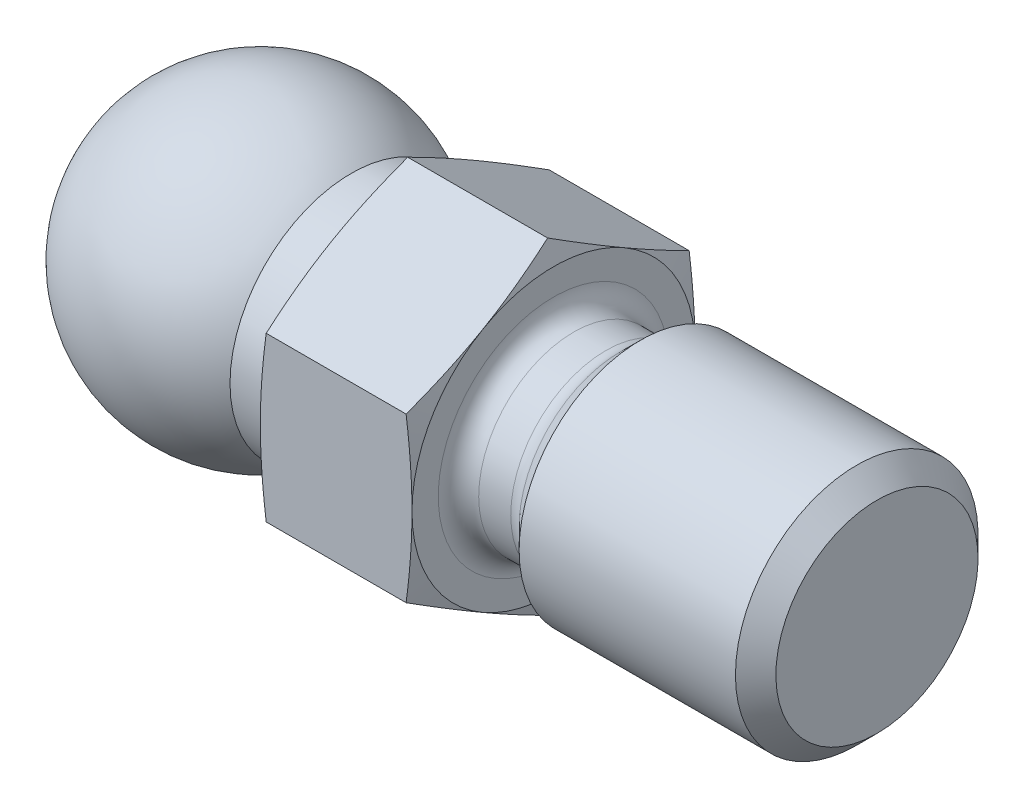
ISO-10303-21;
HEADER;
FILE_DESCRIPTION(('STEP AP214'),'2;1');
FILE_NAME('part.step','',(''),(''),'','','');
FILE_SCHEMA(('AUTOMOTIVE_DESIGN { 1 0 10303 214 1 1 1 1 }'));
ENDSEC;
DATA;
#1=APPLICATION_CONTEXT('core data for automotive mechanical design processes');
#2=APPLICATION_PROTOCOL_DEFINITION('international standard','automotive_design',2000,#1);
#3=PRODUCT_CONTEXT('',#1,'mechanical');
#4=PRODUCT('Part','Part','',(#3));
#5=PRODUCT_RELATED_PRODUCT_CATEGORY('part','',(#4));
#6=PRODUCT_DEFINITION_FORMATION('','',#4);
#7=PRODUCT_DEFINITION_CONTEXT('part definition',#1,'design');
#8=PRODUCT_DEFINITION('design','',#6,#7);
#9=PRODUCT_DEFINITION_SHAPE('','',#8);
#10=(LENGTH_UNIT() NAMED_UNIT(*) SI_UNIT(.MILLI.,.METRE.));
#11=(NAMED_UNIT(*) PLANE_ANGLE_UNIT() SI_UNIT($,.RADIAN.));
#12=(NAMED_UNIT(*) SI_UNIT($,.STERADIAN.) SOLID_ANGLE_UNIT());
#13=UNCERTAINTY_MEASURE_WITH_UNIT(LENGTH_MEASURE(1.E-05),#10,'distance_accuracy_value','');
#14=(GEOMETRIC_REPRESENTATION_CONTEXT(3) GLOBAL_UNCERTAINTY_ASSIGNED_CONTEXT((#13)) GLOBAL_UNIT_ASSIGNED_CONTEXT((#10,
#11,#12)) REPRESENTATION_CONTEXT('',''));
#15=CARTESIAN_POINT('',(0.,0.,0.));
#16=DIRECTION('',(0.,0.,1.));
#17=DIRECTION('',(1.,0.,0.));
#18=AXIS2_PLACEMENT_3D('',#15,#16,#17);
#19=CARTESIAN_POINT('',(16.,16.7012618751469,-25.));
#20=DIRECTION('',(-1.,0.,0.));
#21=DIRECTION('',(0.,-1.,0.));
#22=AXIS2_PLACEMENT_3D('',#19,#20,#21);
#23=PLANE('',#22);
#24=CARTESIAN_POINT('',(16.0000000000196,0.,0.));
#25=DIRECTION('',(-1.,0.,0.));
#26=DIRECTION('',(0.,-1.,0.));
#27=AXIS2_PLACEMENT_3D('',#24,#25,#26);
#28=CIRCLE('',#27,5.0000000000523);
#29=CARTESIAN_POINT('',(16.0000000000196,-5.0000000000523,0.));
#30=VERTEX_POINT('',#29);
#31=EDGE_CURVE('E20',#30,#30,#28,.T.);
#32=ORIENTED_EDGE('',*,*,#31,.F.);
#33=EDGE_LOOP('',(#32));
#34=FACE_BOUND('',#33,.T.);
#35=ADVANCED_FACE('F16',(#34),#23,.F.);
#36=CARTESIAN_POINT('',(15.0000000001,0.,0.));
#37=DIRECTION('',(-1.,0.,0.));
#38=DIRECTION('',(0.,-1.,0.));
#39=AXIS2_PLACEMENT_3D('',#36,#37,#38);
#40=CONICAL_SURFACE('',#39,5.99999999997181,0.785398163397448);
#41=ORIENTED_EDGE('',*,*,#31,.T.);
#42=EDGE_LOOP('',(#41));
#43=FACE_BOUND('',#42,.T.);
#44=CARTESIAN_POINT('',(15.,0.,0.));
#45=DIRECTION('',(-1.,0.,0.));
#46=DIRECTION('',(0.,0.,1.));
#47=AXIS2_PLACEMENT_3D('',#44,#45,#46);
#48=CIRCLE('',#47,6.);
#49=CARTESIAN_POINT('',(15.,0.,6.));
#50=VERTEX_POINT('',#49);
#51=EDGE_CURVE('E427',#50,#50,#48,.T.);
#52=ORIENTED_EDGE('',*,*,#51,.F.);
#53=EDGE_LOOP('',(#52));
#54=FACE_BOUND('',#53,.T.);
#55=ADVANCED_FACE('F177',(#43,#54),#40,.T.);
#56=CARTESIAN_POINT('',(45.,0.,0.));
#57=DIRECTION('',(-1.,0.,0.));
#58=DIRECTION('',(0.,0.,1.));
#59=AXIS2_PLACEMENT_3D('',#56,#57,#58);
#60=CYLINDRICAL_SURFACE('',#59,6.);
#61=ORIENTED_EDGE('',*,*,#51,.T.);
#62=EDGE_LOOP('',(#61));
#63=FACE_BOUND('',#62,.T.);
#64=CARTESIAN_POINT('',(4.30000000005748,0.,0.));
#65=DIRECTION('',(1.,0.,0.));
#66=DIRECTION('',(0.,0.,-1.));
#67=AXIS2_PLACEMENT_3D('',#64,#65,#66);
#68=CIRCLE('',#67,6.00000000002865);
#69=CARTESIAN_POINT('',(4.30000000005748,0.,-6.00000000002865));
#70=VERTEX_POINT('',#69);
#71=EDGE_CURVE('E425',#70,#70,#68,.F.);
#72=ORIENTED_EDGE('',*,*,#71,.F.);
#73=EDGE_LOOP('',(#72));
#74=FACE_BOUND('',#73,.T.);
#75=ADVANCED_FACE('F173',(#63,#74),#60,.T.);
#76=CARTESIAN_POINT('',(4.30000000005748,0.,0.));
#77=DIRECTION('',(1.,0.,0.));
#78=DIRECTION('',(0.,0.,-1.));
#79=AXIS2_PLACEMENT_3D('',#76,#77,#78);
#80=CONICAL_SURFACE('',#79,6.00000000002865,0.785398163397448);
#81=CARTESIAN_POINT('',(3.29289321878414,0.,0.));
#82=DIRECTION('',(1.,0.,0.));
#83=DIRECTION('',(0.,0.,-1.));
#84=AXIS2_PLACEMENT_3D('',#81,#82,#83);
#85=CIRCLE('',#84,4.99289321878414);
#86=CARTESIAN_POINT('',(3.29289321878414,0.,-4.99289321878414));
#87=VERTEX_POINT('',#86);
#88=EDGE_CURVE('E422',#87,#87,#85,.T.);
#89=ORIENTED_EDGE('',*,*,#88,.T.);
#90=EDGE_LOOP('',(#89));
#91=FACE_BOUND('',#90,.T.);
#92=ORIENTED_EDGE('',*,*,#71,.T.);
#93=EDGE_LOOP('',(#92));
#94=FACE_BOUND('',#93,.T.);
#95=ADVANCED_FACE('F170',(#91,#94),#80,.T.);
#96=CARTESIAN_POINT('',(2.5857864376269,0.,0.));
#97=DIRECTION('',(1.,0.,0.));
#98=DIRECTION('',(0.,0.,-1.));
#99=AXIS2_PLACEMENT_3D('',#96,#97,#98);
#100=TOROIDAL_SURFACE('',#99,5.70000000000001,1.00000000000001);
#101=CARTESIAN_POINT('',(2.5857864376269,0.,0.));
#102=DIRECTION('',(-1.,0.,0.));
#103=DIRECTION('',(0.,0.,1.));
#104=AXIS2_PLACEMENT_3D('',#101,#102,#103);
#105=CIRCLE('',#104,4.7);
#106=CARTESIAN_POINT('',(2.5857864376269,0.,4.7));
#107=VERTEX_POINT('',#106);
#108=EDGE_CURVE('E419',#107,#107,#105,.T.);
#109=ORIENTED_EDGE('',*,*,#108,.F.);
#110=EDGE_LOOP('',(#109));
#111=FACE_BOUND('',#110,.T.);
#112=ORIENTED_EDGE('',*,*,#88,.F.);
#113=EDGE_LOOP('',(#112));
#114=FACE_BOUND('',#113,.T.);
#115=ADVANCED_FACE('F168',(#111,#114),#100,.F.);
#116=CARTESIAN_POINT('',(45.,0.,0.));
#117=DIRECTION('',(-1.,0.,0.));
#118=DIRECTION('',(0.,0.,1.));
#119=AXIS2_PLACEMENT_3D('',#116,#117,#118);
#120=CYLINDRICAL_SURFACE('',#119,4.7);
#121=ORIENTED_EDGE('',*,*,#108,.T.);
#122=EDGE_LOOP('',(#121));
#123=FACE_BOUND('',#122,.T.);
#124=CARTESIAN_POINT('',(1.,0.,0.));
#125=DIRECTION('',(1.,0.,0.));
#126=DIRECTION('',(0.,0.,-1.));
#127=AXIS2_PLACEMENT_3D('',#124,#125,#126);
#128=CIRCLE('',#127,4.7);
#129=CARTESIAN_POINT('',(1.,0.,-4.7));
#130=VERTEX_POINT('',#129);
#131=EDGE_CURVE('E416',#130,#130,#128,.T.);
#132=ORIENTED_EDGE('',*,*,#131,.T.);
#133=EDGE_LOOP('',(#132));
#134=FACE_BOUND('',#133,.T.);
#135=ADVANCED_FACE('F165',(#123,#134),#120,.T.);
#136=CARTESIAN_POINT('',(0.999999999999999,0.,0.));
#137=DIRECTION('',(1.,0.,0.));
#138=DIRECTION('',(0.,0.,-1.));
#139=AXIS2_PLACEMENT_3D('',#136,#137,#138);
#140=TOROIDAL_SURFACE('',#139,5.7,1.);
#141=CARTESIAN_POINT('',(0.,0.,0.));
#142=DIRECTION('',(1.,0.,0.));
#143=DIRECTION('',(0.,0.,-1.));
#144=AXIS2_PLACEMENT_3D('',#141,#142,#143);
#145=CIRCLE('',#144,5.7);
#146=CARTESIAN_POINT('',(0.,0.,-5.7));
#147=VERTEX_POINT('',#146);
#148=EDGE_CURVE('E131',#147,#147,#145,.T.);
#149=ORIENTED_EDGE('',*,*,#148,.T.);
#150=EDGE_LOOP('',(#149));
#151=FACE_BOUND('',#150,.T.);
#152=ORIENTED_EDGE('',*,*,#131,.F.);
#153=EDGE_LOOP('',(#152));
#154=FACE_BOUND('',#153,.T.);
#155=ADVANCED_FACE('F163',(#151,#154),#140,.F.);
#156=CARTESIAN_POINT('',(0.,7.,0.));
#157=DIRECTION('',(-1.,0.,0.));
#158=DIRECTION('',(0.,0.,1.));
#159=AXIS2_PLACEMENT_3D('',#156,#157,#158);
#160=PLANE('',#159);
#161=ORIENTED_EDGE('',*,*,#148,.F.);
#162=EDGE_LOOP('',(#161));
#163=FACE_BOUND('',#162,.T.);
#164=CARTESIAN_POINT('',(0.,0.,0.));
#165=DIRECTION('',(-1.,0.,0.));
#166=DIRECTION('',(0.,0.,1.));
#167=AXIS2_PLACEMENT_3D('',#164,#165,#166);
#168=CIRCLE('',#167,7.);
#169=CARTESIAN_POINT('',(0.,0.,7.));
#170=VERTEX_POINT('',#169);
#171=CARTESIAN_POINT('',(0.,6.06217782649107,3.5));
#172=VERTEX_POINT('',#171);
#173=EDGE_CURVE('E103',#170,#172,#168,.T.);
#174=ORIENTED_EDGE('',*,*,#173,.F.);
#175=CARTESIAN_POINT('',(0.,0.,0.));
#176=DIRECTION('',(-1.,0.,0.));
#177=DIRECTION('',(0.,0.,1.));
#178=AXIS2_PLACEMENT_3D('',#175,#176,#177);
#179=CIRCLE('',#178,7.);
#180=CARTESIAN_POINT('',(0.,-6.06217782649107,3.5));
#181=VERTEX_POINT('',#180);
#182=EDGE_CURVE('E130',#181,#170,#179,.T.);
#183=ORIENTED_EDGE('',*,*,#182,.F.);
#184=CARTESIAN_POINT('',(0.,0.,0.));
#185=DIRECTION('',(-1.,0.,0.));
#186=DIRECTION('',(0.,0.,1.));
#187=AXIS2_PLACEMENT_3D('',#184,#185,#186);
#188=CIRCLE('',#187,7.);
#189=CARTESIAN_POINT('',(0.,-6.06217782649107,-3.5));
#190=VERTEX_POINT('',#189);
#191=EDGE_CURVE('E444',#190,#181,#188,.T.);
#192=ORIENTED_EDGE('',*,*,#191,.F.);
#193=CARTESIAN_POINT('',(0.,0.,0.));
#194=DIRECTION('',(-1.,0.,0.));
#195=DIRECTION('',(0.,0.,1.));
#196=AXIS2_PLACEMENT_3D('',#193,#194,#195);
#197=CIRCLE('',#196,7.);
#198=CARTESIAN_POINT('',(0.,0.,-7.));
#199=VERTEX_POINT('',#198);
#200=EDGE_CURVE('E447',#199,#190,#197,.T.);
#201=ORIENTED_EDGE('',*,*,#200,.F.);
#202=CARTESIAN_POINT('',(0.,0.,0.));
#203=DIRECTION('',(-1.,0.,0.));
#204=DIRECTION('',(0.,0.,1.));
#205=AXIS2_PLACEMENT_3D('',#202,#203,#204);
#206=CIRCLE('',#205,7.);
#207=CARTESIAN_POINT('',(0.,6.06217782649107,-3.5));
#208=VERTEX_POINT('',#207);
#209=EDGE_CURVE('E110',#208,#199,#206,.T.);
#210=ORIENTED_EDGE('',*,*,#209,.F.);
#211=CARTESIAN_POINT('',(0.,0.,0.));
#212=DIRECTION('',(-1.,0.,0.));
#213=DIRECTION('',(0.,-1.,0.));
#214=AXIS2_PLACEMENT_3D('',#211,#212,#213);
#215=CIRCLE('',#214,7.);
#216=EDGE_CURVE('E106',#172,#208,#215,.T.);
#217=ORIENTED_EDGE('',*,*,#216,.F.);
#218=EDGE_LOOP('',(#174,#183,#192,#201,#210,#217));
#219=FACE_BOUND('',#218,.T.);
#220=ADVANCED_FACE('F108',(#163,#219),#160,.F.);
#221=CARTESIAN_POINT('',(-0.291904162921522,0.,0.));
#222=DIRECTION('',(-1.,0.,0.));
#223=DIRECTION('',(0.,0.,1.));
#224=AXIS2_PLACEMENT_3D('',#221,#222,#223);
#225=CONICAL_SURFACE('',#224,8.08940116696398,1.30899693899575);
#226=CARTESIAN_POINT('',(-0.290163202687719,4.04145186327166,7.0000000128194));
#227=CARTESIAN_POINT('',(-0.245257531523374,4.20896414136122,6.70986025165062));
#228=CARTESIAN_POINT('',(-0.204486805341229,4.37678623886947,6.41918385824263));
#229=CARTESIAN_POINT('',(-0.132888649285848,4.71276276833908,5.83725544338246));
#230=CARTESIAN_POINT('',(-0.102049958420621,4.88091660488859,5.54600445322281));
#231=CARTESIAN_POINT('',(-0.0644187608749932,5.13349076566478,5.10853317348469));
#232=CARTESIAN_POINT('',(-0.0533118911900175,5.21775111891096,4.96258996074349));
#233=CARTESIAN_POINT('',(-0.0341360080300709,5.38635858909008,4.67055325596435));
#234=CARTESIAN_POINT('',(-0.0260669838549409,5.47070570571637,4.52445976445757));
#235=CARTESIAN_POINT('',(-0.0130936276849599,5.63955643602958,4.23200172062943));
#236=CARTESIAN_POINT('',(-0.00819287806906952,5.72406011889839,4.08563704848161));
#237=CARTESIAN_POINT('',(-0.00164120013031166,5.89310158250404,3.79284864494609));
#238=CARTESIAN_POINT('',(9.6236296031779E-06,5.97763936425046,3.64642491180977));
#239=CARTESIAN_POINT('',(0.,6.06217782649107,3.5));
#240=B_SPLINE_CURVE_WITH_KNOTS('',3,(#226,#227,#228,#229,#230,#231,#232,#233,#234,#235,#236,
#237,#238,#239),.UNSPECIFIED.,.F.,.F.,(4,2,2,2,2,2,4),(0.,1.01414052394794,2.02712712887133,
2.53376124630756,3.0403935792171,3.54759776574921,4.05481827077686),.UNSPECIFIED.);
#241=CARTESIAN_POINT('',(-0.290163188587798,4.04145185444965,7.00000000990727));
#242=VERTEX_POINT('',#241);
#243=EDGE_CURVE('E122',#242,#172,#240,.T.);
#244=ORIENTED_EDGE('',*,*,#243,.F.);
#245=CARTESIAN_POINT('',(0.,0.,7.));
#246=CARTESIAN_POINT('',(9.62362302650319E-06,0.169076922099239,7.));
#247=CARTESIAN_POINT('',(-0.0016412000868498,0.338152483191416,7.));
#248=CARTESIAN_POINT('',(-0.00819287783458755,0.676235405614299,7.));
#249=CARTESIAN_POINT('',(-0.0130936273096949,0.845242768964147,7.));
#250=CARTESIAN_POINT('',(-0.0260669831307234,1.18294422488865,7.));
#251=CARTESIAN_POINT('',(-0.0341360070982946,1.351638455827,7.));
#252=CARTESIAN_POINT('',(-0.0533118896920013,1.68885339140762,7.));
#253=CARTESIAN_POINT('',(-0.0644187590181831,1.85737409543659,7.));
#254=CARTESIAN_POINT('',(-0.102049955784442,2.36252241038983,7.));
#255=CARTESIAN_POINT('',(-0.132888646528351,2.69883008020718,7.));
#256=CARTESIAN_POINT('',(-0.204486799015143,3.37078312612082,7.));
#257=CARTESIAN_POINT('',(-0.245257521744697,3.7064273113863,7.));
#258=CARTESIAN_POINT('',(-0.290163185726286,4.04145185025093,7.));
#259=B_SPLINE_CURVE_WITH_KNOTS('',3,(#245,#246,#247,#248,#249,#250,#251,#252,#253,#254,#255,
#256,#257,#258),.UNSPECIFIED.,.F.,.F.,(4,2,2,2,2,2,4),(0.,0.507220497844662,1.01442467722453,
1.52105700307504,2.02769111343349,3.04067770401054,4.05481821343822),.UNSPECIFIED.);
#260=EDGE_CURVE('E128',#170,#242,#259,.T.);
#261=ORIENTED_EDGE('',*,*,#260,.F.);
#262=ORIENTED_EDGE('',*,*,#173,.T.);
#263=EDGE_LOOP('',(#244,#261,#262));
#264=FACE_BOUND('',#263,.T.);
#265=ADVANCED_FACE('F125',(#264),#225,.T.);
#266=CARTESIAN_POINT('',(-0.29190417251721,0.,0.));
#267=DIRECTION('',(-1.,0.,0.));
#268=DIRECTION('',(0.,0.,1.));
#269=AXIS2_PLACEMENT_3D('',#266,#267,#268);
#270=CONICAL_SURFACE('',#269,8.08940120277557,1.30899693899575);
#271=ORIENTED_EDGE('',*,*,#182,.T.);
#272=CARTESIAN_POINT('',(-0.290163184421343,-4.0414518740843,7.00000000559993));
#273=CARTESIAN_POINT('',(-0.245257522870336,-3.70642733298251,7.00000000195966));
#274=CARTESIAN_POINT('',(-0.204486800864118,-3.37078314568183,7.00000000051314));
#275=CARTESIAN_POINT('',(-0.132888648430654,-2.69883009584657,6.99999999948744));
#276=CARTESIAN_POINT('',(-0.102049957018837,-2.36252242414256,6.99999999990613));
#277=CARTESIAN_POINT('',(-0.0644187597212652,-1.85737410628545,7.00000000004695));
#278=CARTESIAN_POINT('',(-0.0533118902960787,-1.68885340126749,7.00000000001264));
#279=CARTESIAN_POINT('',(-0.034136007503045,-1.35163846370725,6.99999999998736));
#280=CARTESIAN_POINT('',(-0.0260669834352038,-1.18294423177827,6.99999999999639));
#281=CARTESIAN_POINT('',(-0.013093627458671,-0.845242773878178,7.00000000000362));
#282=CARTESIAN_POINT('',(-0.00819287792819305,-0.676235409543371,7.00000000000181));
#283=CARTESIAN_POINT('',(-0.00164120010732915,-0.338152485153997,6.99999999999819));
#284=CARTESIAN_POINT('',(9.62362038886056E-06,-0.16907692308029,6.99999999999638));
#285=CARTESIAN_POINT('',(0.,0.,7.));
#286=B_SPLINE_CURVE_WITH_KNOTS('',3,(#272,#273,#274,#275,#276,#277,#278,#279,#280,#281,#282,
#283,#284,#285),.UNSPECIFIED.,.F.,.F.,(4,2,2,2,2,2,4),(0.,1.01414051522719,2.02712711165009,
2.53376122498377,3.04039355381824,3.54759773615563,4.05481823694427),.UNSPECIFIED.);
#287=CARTESIAN_POINT('',(-0.290163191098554,-4.04145187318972,7.00000000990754));
#288=VERTEX_POINT('',#287);
#289=EDGE_CURVE('E301',#288,#170,#286,.T.);
#290=ORIENTED_EDGE('',*,*,#289,.F.);
#291=CARTESIAN_POINT('',(0.,-6.06217782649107,3.5));
#292=CARTESIAN_POINT('',(9.62362350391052E-06,-5.97763936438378,3.64642491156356));
#293=CARTESIAN_POINT('',(-0.00164120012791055,-5.89310158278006,3.79284864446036));
#294=CARTESIAN_POINT('',(-0.00819287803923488,-5.7240601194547,4.08563704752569));
#295=CARTESIAN_POINT('',(-0.0130936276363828,-5.63955643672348,4.23200171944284));
#296=CARTESIAN_POINT('',(-0.0260669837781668,-5.47070570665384,4.52445976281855));
#297=CARTESIAN_POINT('',(-0.0341360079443,-5.38635859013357,4.6705532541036));
#298=CARTESIAN_POINT('',(-0.0533118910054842,-5.21775112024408,4.96258995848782));
#299=CARTESIAN_POINT('',(-0.0644187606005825,-5.13349076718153,5.10853317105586));
#300=CARTESIAN_POINT('',(-0.102049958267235,-4.88091660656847,5.54600444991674));
#301=CARTESIAN_POINT('',(-0.132888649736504,-4.71276276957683,5.83725543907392));
#302=CARTESIAN_POINT('',(-0.204486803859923,-4.37678624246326,6.41918385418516));
#303=CARTESIAN_POINT('',(-0.245257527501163,-4.20896414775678,6.70986024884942));
#304=CARTESIAN_POINT('',(-0.290163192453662,-4.0414518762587,7.00000001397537));
#305=B_SPLINE_CURVE_WITH_KNOTS('',3,(#291,#292,#293,#294,#295,#296,#297,#298,#299,#300,#301,
#302,#303,#304),.UNSPECIFIED.,.F.,.F.,(4,2,2,2,2,2,4),(0.,0.507220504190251,1.01442468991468,
1.52105702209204,2.02769113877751,3.04067774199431,4.05481826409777),.UNSPECIFIED.);
#306=EDGE_CURVE('E414',#181,#288,#305,.T.);
#307=ORIENTED_EDGE('',*,*,#306,.F.);
#308=EDGE_LOOP('',(#271,#290,#307));
#309=FACE_BOUND('',#308,.T.);
#310=ADVANCED_FACE('F157',(#309),#270,.T.);
#311=CARTESIAN_POINT('',(-0.291904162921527,0.,0.));
#312=DIRECTION('',(-1.,0.,0.));
#313=DIRECTION('',(0.,0.,1.));
#314=AXIS2_PLACEMENT_3D('',#311,#312,#313);
#315=CONICAL_SURFACE('',#314,8.089401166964,1.30899693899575);
#316=CARTESIAN_POINT('',(-0.290163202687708,-8.08290376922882,-2.46444722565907E-08));
#317=CARTESIAN_POINT('',(-0.245257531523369,-7.91539150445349,0.290139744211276));
#318=CARTESIAN_POINT('',(-0.204486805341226,-7.74756941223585,0.580816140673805));
#319=CARTESIAN_POINT('',(-0.132888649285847,-7.41159288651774,1.16274455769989));
#320=CARTESIAN_POINT('',(-0.10204995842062,-7.24343904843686,1.45399554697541));
#321=CARTESIAN_POINT('',(-0.0644187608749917,-6.99086488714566,1.89146682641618));
#322=CARTESIAN_POINT('',(-0.053311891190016,-6.90660453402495,2.03741003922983));
#323=CARTESIAN_POINT('',(-0.0341360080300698,-6.73799706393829,2.32944674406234));
#324=CARTESIAN_POINT('',(-0.0260669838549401,-6.65364994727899,2.47554023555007));
#325=CARTESIAN_POINT('',(-0.0130936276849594,-6.48479921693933,2.76799827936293));
#326=CARTESIAN_POINT('',(-0.00819287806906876,-6.40029553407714,2.91436295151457));
#327=CARTESIAN_POINT('',(-0.00164120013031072,-6.23125407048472,3.20715135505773));
#328=CARTESIAN_POINT('',(9.62362960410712E-06,-6.14671628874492,3.35357508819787));
#329=CARTESIAN_POINT('',(0.,-6.06217782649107,3.5));
#330=B_SPLINE_CURVE_WITH_KNOTS('',3,(#316,#317,#318,#319,#320,#321,#322,#323,#324,#325,#326,
#327,#328,#329),.UNSPECIFIED.,.F.,.F.,(4,2,2,2,2,2,4),(0.,1.01414052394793,2.02712712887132,
2.53376124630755,3.04039357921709,3.54759776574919,4.05481827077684),.UNSPECIFIED.);
#331=CARTESIAN_POINT('',(-0.290163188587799,-8.08290376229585,-3.08284921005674E-08));
#332=VERTEX_POINT('',#331);
#333=EDGE_CURVE('E368',#332,#181,#330,.T.);
#334=ORIENTED_EDGE('',*,*,#333,.F.);
#335=CARTESIAN_POINT('',(0.,-6.06217782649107,-3.50000000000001));
#336=CARTESIAN_POINT('',(9.62362302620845E-06,-6.14671628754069,-3.35357509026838));
#337=CARTESIAN_POINT('',(-0.00164120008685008,-6.23125406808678,-3.20715135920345));
#338=CARTESIAN_POINT('',(-0.0081928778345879,-6.40029552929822,-2.91436295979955));
#339=CARTESIAN_POINT('',(-0.0130936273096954,-6.48479921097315,-2.76799828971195));
#340=CARTESIAN_POINT('',(-0.0260669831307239,-6.6536499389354,-2.47554024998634));
#341=CARTESIAN_POINT('',(-0.0341360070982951,-6.73799705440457,-2.32944676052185));
#342=CARTESIAN_POINT('',(-0.0533118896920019,-6.90660452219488,-2.03741005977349));
#343=CARTESIAN_POINT('',(-0.0644187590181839,-6.99086487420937,-1.89146684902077));
#344=CARTESIAN_POINT('',(-0.102049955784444,-7.24343903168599,-1.45399557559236));
#345=CARTESIAN_POINT('',(-0.132888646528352,-7.41159286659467,-1.16274459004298));
#346=CARTESIAN_POINT('',(-0.204486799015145,-7.74756938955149,-0.580816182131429));
#347=CARTESIAN_POINT('',(-0.245257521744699,-7.91539148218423,-0.290139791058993));
#348=CARTESIAN_POINT('',(-0.290163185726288,-8.08290375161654,-2.95110560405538E-08));
#349=B_SPLINE_CURVE_WITH_KNOTS('',3,(#335,#336,#337,#338,#339,#340,#341,#342,#343,#344,#345,
#346,#347,#348),.UNSPECIFIED.,.F.,.F.,(4,2,2,2,2,2,4),(0.,0.507220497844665,1.01442467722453,
1.52105700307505,2.0276911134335,3.04067770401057,4.05481821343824),.UNSPECIFIED.);
#350=EDGE_CURVE('E361',#190,#332,#349,.T.);
#351=ORIENTED_EDGE('',*,*,#350,.F.);
#352=ORIENTED_EDGE('',*,*,#191,.T.);
#353=EDGE_LOOP('',(#334,#351,#352));
#354=FACE_BOUND('',#353,.T.);
#355=ADVANCED_FACE('F372',(#354),#315,.T.);
#356=CARTESIAN_POINT('',(-0.29190416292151,0.,0.));
#357=DIRECTION('',(-1.,0.,0.));
#358=DIRECTION('',(0.,0.,1.));
#359=AXIS2_PLACEMENT_3D('',#356,#357,#358);
#360=CONICAL_SURFACE('',#359,8.08940116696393,1.30899693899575);
#361=CARTESIAN_POINT('',(-0.290163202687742,-4.04145186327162,-7.00000001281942));
#362=CARTESIAN_POINT('',(-0.245257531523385,-4.2089641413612,-6.70986025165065));
#363=CARTESIAN_POINT('',(-0.204486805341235,-4.37678623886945,-6.41918385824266));
#364=CARTESIAN_POINT('',(-0.132888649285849,-4.71276276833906,-5.83725544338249));
#365=CARTESIAN_POINT('',(-0.102049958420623,-4.88091660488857,-5.54600445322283));
#366=CARTESIAN_POINT('',(-0.064418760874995,-5.13349076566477,-5.10853317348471));
#367=CARTESIAN_POINT('',(-0.0533118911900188,-5.21775111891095,-4.96258996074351));
#368=CARTESIAN_POINT('',(-0.0341360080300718,-5.38635858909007,-4.67055325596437));
#369=CARTESIAN_POINT('',(-0.0260669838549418,-5.47070570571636,-4.52445976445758));
#370=CARTESIAN_POINT('',(-0.0130936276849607,-5.63955643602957,-4.23200172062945));
#371=CARTESIAN_POINT('',(-0.00819287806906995,-5.72406011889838,-4.08563704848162));
#372=CARTESIAN_POINT('',(-0.00164120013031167,-5.89310158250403,-3.7928486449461));
#373=CARTESIAN_POINT('',(9.62362960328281E-06,-5.97763936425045,-3.64642491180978));
#374=CARTESIAN_POINT('',(0.,-6.06217782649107,-3.50000000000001));
#375=B_SPLINE_CURVE_WITH_KNOTS('',3,(#361,#362,#363,#364,#365,#366,#367,#368,#369,#370,#371,
#372,#373,#374),.UNSPECIFIED.,.F.,.F.,(4,2,2,2,2,2,4),(0.,1.01414052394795,2.02712712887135,
2.53376124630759,3.04039357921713,3.54759776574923,4.0548182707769),.UNSPECIFIED.);
#376=CARTESIAN_POINT('',(-0.290163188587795,-4.04145185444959,-7.00000000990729));
#377=VERTEX_POINT('',#376);
#378=EDGE_CURVE('E353',#377,#190,#375,.T.);
#379=ORIENTED_EDGE('',*,*,#378,.F.);
#380=CARTESIAN_POINT('',(0.,0.,-7.));
#381=CARTESIAN_POINT('',(9.62362302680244E-06,-0.169076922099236,-7.));
#382=CARTESIAN_POINT('',(-0.00164120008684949,-0.338152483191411,-7.));
#383=CARTESIAN_POINT('',(-0.00819287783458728,-0.676235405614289,-7.));
#384=CARTESIAN_POINT('',(-0.0130936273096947,-0.845242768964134,-7.));
#385=CARTESIAN_POINT('',(-0.0260669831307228,-1.18294422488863,-7.));
#386=CARTESIAN_POINT('',(-0.0341360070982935,-1.35163845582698,-7.));
#387=CARTESIAN_POINT('',(-0.0533118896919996,-1.68885339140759,-7.));
#388=CARTESIAN_POINT('',(-0.0644187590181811,-1.85737409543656,-7.));
#389=CARTESIAN_POINT('',(-0.102049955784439,-2.36252241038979,-7.));
#390=CARTESIAN_POINT('',(-0.132888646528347,-2.69883008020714,-7.));
#391=CARTESIAN_POINT('',(-0.204486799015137,-3.37078312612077,-7.));
#392=CARTESIAN_POINT('',(-0.245257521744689,-3.70642731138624,-7.));
#393=CARTESIAN_POINT('',(-0.290163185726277,-4.04145185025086,-7.));
#394=B_SPLINE_CURVE_WITH_KNOTS('',3,(#380,#381,#382,#383,#384,#385,#386,#387,#388,#389,#390,
#391,#392,#393),.UNSPECIFIED.,.F.,.F.,(4,2,2,2,2,2,4),(0.,0.507220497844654,1.01442467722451,
1.52105700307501,2.02769111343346,3.0406777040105,4.05481821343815),.UNSPECIFIED.);
#395=EDGE_CURVE('E385',#199,#377,#394,.T.);
#396=ORIENTED_EDGE('',*,*,#395,.F.);
#397=ORIENTED_EDGE('',*,*,#200,.T.);
#398=EDGE_LOOP('',(#379,#396,#397));
#399=FACE_BOUND('',#398,.T.);
#400=ADVANCED_FACE('F375',(#399),#360,.T.);
#401=CARTESIAN_POINT('',(-0.291904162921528,0.,0.));
#402=DIRECTION('',(-1.,0.,0.));
#403=DIRECTION('',(0.,0.,1.));
#404=AXIS2_PLACEMENT_3D('',#401,#402,#403);
#405=CONICAL_SURFACE('',#404,8.089401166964,1.30899693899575);
#406=CARTESIAN_POINT('',(-0.290163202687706,4.04145190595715,-6.99999998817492));
#407=CARTESIAN_POINT('',(-0.245257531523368,3.70642736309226,-6.99999999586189));
#408=CARTESIAN_POINT('',(-0.204486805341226,3.37078317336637,-6.99999999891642));
#409=CARTESIAN_POINT('',(-0.132888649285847,2.69883011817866,-7.00000000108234));
#410=CARTESIAN_POINT('',(-0.10204995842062,2.36252244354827,-7.00000000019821));
#411=CARTESIAN_POINT('',(-0.064418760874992,1.85737412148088,-6.99999999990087));
#412=CARTESIAN_POINT('',(-0.0533118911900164,1.68885341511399,-6.99999999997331));
#413=CARTESIAN_POINT('',(-0.03413600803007,1.35163847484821,-7.00000000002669));
#414=CARTESIAN_POINT('',(-0.0260669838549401,1.18294424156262,-7.00000000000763));
#415=CARTESIAN_POINT('',(-0.0130936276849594,0.845242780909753,-6.99999999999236));
#416=CARTESIAN_POINT('',(-0.00819287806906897,0.676235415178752,-6.99999999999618));
#417=CARTESIAN_POINT('',(-0.00164120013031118,0.338152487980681,-7.00000000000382));
#418=CARTESIAN_POINT('',(9.62362960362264E-06,0.169076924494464,-7.00000000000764));
#419=CARTESIAN_POINT('',(0.,0.,-7.));
#420=B_SPLINE_CURVE_WITH_KNOTS('',3,(#406,#407,#408,#409,#410,#411,#412,#413,#414,#415,#416,
#417,#418,#419),.UNSPECIFIED.,.F.,.F.,(4,2,2,2,2,2,4),(0.,1.01414052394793,2.02712712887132,
2.53376124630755,3.04039357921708,3.54759776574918,4.05481827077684),.UNSPECIFIED.);
#421=CARTESIAN_POINT('',(-0.290163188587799,4.04145190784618,-6.99999997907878));
#422=VERTEX_POINT('',#421);
#423=EDGE_CURVE('E392',#422,#199,#420,.T.);
#424=ORIENTED_EDGE('',*,*,#423,.F.);
#425=CARTESIAN_POINT('',(0.,6.06217782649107,-3.5));
#426=CARTESIAN_POINT('',(9.623623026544E-06,5.97763936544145,-3.64642490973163));
#427=CARTESIAN_POINT('',(-0.00164120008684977,5.89310158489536,-3.79284864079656));
#428=CARTESIAN_POINT('',(-0.00819287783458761,5.72406012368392,-4.08563704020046));
#429=CARTESIAN_POINT('',(-0.0130936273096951,5.63955644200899,-4.23200171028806));
#430=CARTESIAN_POINT('',(-0.0260669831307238,5.47070571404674,-4.52445975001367));
#431=CARTESIAN_POINT('',(-0.0341360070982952,5.38635859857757,-4.67055323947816));
#432=CARTESIAN_POINT('',(-0.0533118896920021,5.21775113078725,-4.96258994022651));
#433=CARTESIAN_POINT('',(-0.064418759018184,5.13349077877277,-5.10853315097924));
#434=CARTESIAN_POINT('',(-0.102049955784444,4.88091662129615,-5.54600442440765));
#435=CARTESIAN_POINT('',(-0.132888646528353,4.71276278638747,-5.83725540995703));
#436=CARTESIAN_POINT('',(-0.204486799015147,4.37678626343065,-6.41918381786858));
#437=CARTESIAN_POINT('',(-0.2452575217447,4.20896417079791,-6.70986020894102));
#438=CARTESIAN_POINT('',(-0.29016318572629,4.04145190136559,-6.99999997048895));
#439=B_SPLINE_CURVE_WITH_KNOTS('',3,(#425,#426,#427,#428,#429,#430,#431,#432,#433,#434,#435,
#436,#437,#438),.UNSPECIFIED.,.F.,.F.,(4,2,2,2,2,2,4),(0.,0.507220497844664,1.01442467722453,
1.52105700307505,2.0276911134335,3.04067770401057,4.05481821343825),.UNSPECIFIED.);
#440=EDGE_CURVE('E397',#208,#422,#439,.T.);
#441=ORIENTED_EDGE('',*,*,#440,.F.);
#442=ORIENTED_EDGE('',*,*,#209,.T.);
#443=EDGE_LOOP('',(#424,#441,#442));
#444=FACE_BOUND('',#443,.T.);
#445=ADVANCED_FACE('F381',(#444),#405,.T.);
#446=CARTESIAN_POINT('',(-0.291904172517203,0.,0.));
#447=DIRECTION('',(-1.,0.,0.));
#448=DIRECTION('',(0.,-1.,0.));
#449=AXIS2_PLACEMENT_3D('',#446,#447,#448);
#450=CONICAL_SURFACE('',#449,8.08940120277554,1.30899693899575);
#451=ORIENTED_EDGE('',*,*,#216,.T.);
#452=CARTESIAN_POINT('',(-0.290163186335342,8.08290376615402,-1.06799541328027E-08));
#453=CARTESIAN_POINT('',(-0.245257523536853,7.91539149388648,-0.290139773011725));
#454=CARTESIAN_POINT('',(-0.204486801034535,7.74756939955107,-0.580816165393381));
#455=CARTESIAN_POINT('',(-0.132888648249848,7.41159287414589,-1.16274457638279));
#456=CARTESIAN_POINT('',(-0.102049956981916,7.24343903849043,-1.45399556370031));
#457=CARTESIAN_POINT('',(-0.0644187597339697,6.9908648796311,-1.89146683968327));
#458=CARTESIAN_POINT('',(-0.0533118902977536,6.90660452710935,-2.03741005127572));
#459=CARTESIAN_POINT('',(-0.034136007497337,6.73799705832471,-2.32944675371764));
#460=CARTESIAN_POINT('',(-0.0260669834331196,6.65364994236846,-2.47554024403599));
#461=CARTESIAN_POINT('',(-0.0130936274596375,6.48479921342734,-2.76799828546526));
#462=CARTESIAN_POINT('',(-0.00819287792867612,6.40029553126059,-2.91436295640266));
#463=CARTESIAN_POINT('',(-0.00164120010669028,6.23125406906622,-3.20715135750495));
#464=CARTESIAN_POINT('',(9.6236216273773E-06,6.14671628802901,-3.35357508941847));
#465=CARTESIAN_POINT('',(0.,6.06217782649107,-3.5));
#466=B_SPLINE_CURVE_WITH_KNOTS('',3,(#452,#453,#454,#455,#456,#457,#458,#459,#460,#461,#462,
#463,#464,#465),.UNSPECIFIED.,.F.,.F.,(4,2,2,2,2,2,4),(0.,1.01414051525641,2.02712711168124,
2.53376122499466,3.04039355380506,3.54759773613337,4.05481823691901),.UNSPECIFIED.);
#467=CARTESIAN_POINT('',(-0.290163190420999,8.08290376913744,-1.02194583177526E-08));
#468=VERTEX_POINT('',#467);
#469=EDGE_CURVE('E118',#468,#208,#466,.T.);
#470=ORIENTED_EDGE('',*,*,#469,.F.);
#471=CARTESIAN_POINT('',(0.,6.06217782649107,3.5));
#472=CARTESIAN_POINT('',(9.62362347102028E-06,6.14671628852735,3.35357508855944));
#473=CARTESIAN_POINT('',(-0.00164120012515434,6.23125407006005,3.20715135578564));
#474=CARTESIAN_POINT('',(-0.00819287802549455,6.40029553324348,2.91436295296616));
#475=CARTESIAN_POINT('',(-0.013093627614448,6.48479921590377,2.76799828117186));
#476=CARTESIAN_POINT('',(-0.0260669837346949,6.65364994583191,2.47554023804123));
#477=CARTESIAN_POINT('',(-0.0341360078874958,6.73799706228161,2.32944674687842));
#478=CARTESIAN_POINT('',(-0.0533118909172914,6.90660453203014,2.03741004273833));
#479=CARTESIAN_POINT('',(-0.0644187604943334,6.99086488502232,1.89146683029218));
#480=CARTESIAN_POINT('',(-0.102049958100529,7.24343904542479,1.45399555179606));
#481=CARTESIAN_POINT('',(-0.132888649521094,7.41159288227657,1.16274456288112));
#482=CARTESIAN_POINT('',(-0.204486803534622,7.74756940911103,0.580816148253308));
#483=CARTESIAN_POINT('',(-0.245257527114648,7.91539150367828,0.290139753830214));
#484=CARTESIAN_POINT('',(-0.290163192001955,8.08290377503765,-1.10554913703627E-08));
#485=B_SPLINE_CURVE_WITH_KNOTS('',3,(#471,#472,#473,#474,#475,#476,#477,#478,#479,#480,#481,
#482,#483,#484),.UNSPECIFIED.,.F.,.F.,(4,2,2,2,2,2,4),(0.,0.507220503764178,1.0144246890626,
1.52105702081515,2.02769113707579,3.0406777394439,4.05481826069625),.UNSPECIFIED.);
#486=EDGE_CURVE('E115',#172,#468,#485,.T.);
#487=ORIENTED_EDGE('',*,*,#486,.F.);
#488=EDGE_LOOP('',(#451,#470,#487));
#489=FACE_BOUND('',#488,.T.);
#490=ADVANCED_FACE('F117',(#489),#450,.T.);
#491=CARTESIAN_POINT('',(-7.5,8.08290376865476,0.));
#492=DIRECTION('',(0.,0.866025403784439,0.5));
#493=DIRECTION('',(0.,-0.5,0.866025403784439));
#494=AXIS2_PLACEMENT_3D('',#491,#492,#493);
#495=PLANE('',#494);
#496=DIRECTION('',(1.,0.,0.));
#497=VECTOR('',#496,1.);
#498=CARTESIAN_POINT('',(-7.5,4.04145183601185,7.));
#499=LINE('',#498,#497);
#500=CARTESIAN_POINT('',(-7.20983680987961,4.04145184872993,7.00000001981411));
#501=VERTEX_POINT('',#500);
#502=EDGE_CURVE('E135',#242,#501,#499,.F.);
#503=ORIENTED_EDGE('',*,*,#502,.F.);
#504=ORIENTED_EDGE('',*,*,#243,.T.);
#505=ORIENTED_EDGE('',*,*,#486,.T.);
#506=DIRECTION('',(1.,0.,0.));
#507=VECTOR('',#506,1.);
#508=CARTESIAN_POINT('',(-7.5,8.08290376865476,0.));
#509=LINE('',#508,#507);
#510=CARTESIAN_POINT('',(-7.20983681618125,8.08290374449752,-4.18415545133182E-08));
#511=VERTEX_POINT('',#510);
#512=EDGE_CURVE('E404',#511,#468,#509,.T.);
#513=ORIENTED_EDGE('',*,*,#512,.F.);
#514=CARTESIAN_POINT('',(-7.5,6.06217782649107,3.5));
#515=CARTESIAN_POINT('',(-7.50000962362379,6.14671628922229,3.35357508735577));
#516=CARTESIAN_POINT('',(-7.49835879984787,6.23125407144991,3.20715135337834));
#517=CARTESIAN_POINT('',(-7.49180712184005,6.40029553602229,2.91436294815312));
#518=CARTESIAN_POINT('',(-7.48690637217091,6.48479921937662,2.76799827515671));
#519=CARTESIAN_POINT('',(-7.47393301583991,6.65364995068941,2.47554022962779));
#520=CARTESIAN_POINT('',(-7.46586399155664,6.73799706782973,2.32944673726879));
#521=CARTESIAN_POINT('',(-7.44668810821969,6.90660453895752,2.03741003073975));
#522=CARTESIAN_POINT('',(-7.43558123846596,6.99086489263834,1.89146681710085));
#523=CARTESIAN_POINT('',(-7.39795004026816,7.2434390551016,1.45399553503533));
#524=CARTESIAN_POINT('',(-7.367111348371,7.411592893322,1.16274454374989));
#525=CARTESIAN_POINT('',(-7.29551319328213,7.74756942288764,0.580816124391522));
#526=CARTESIAN_POINT('',(-7.25474246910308,7.91539151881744,0.290139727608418));
#527=CARTESIAN_POINT('',(-7.20983680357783,8.08290379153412,-3.96282170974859E-08));
#528=B_SPLINE_CURVE_WITH_KNOTS('',3,(#514,#515,#516,#517,#518,#519,#520,#521,#522,#523,#524,
#525,#526,#527),.UNSPECIFIED.,.F.,.F.,(4,2,2,2,2,2,4),(0.,0.50722050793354,1.01442469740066,
1.52105703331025,2.02769115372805,3.0406777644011,4.05481829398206),.UNSPECIFIED.);
#529=CARTESIAN_POINT('',(-7.5,6.06217782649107,3.5));
#530=VERTEX_POINT('',#529);
#531=EDGE_CURVE('E272',#530,#511,#528,.T.);
#532=ORIENTED_EDGE('',*,*,#531,.F.);
#533=CARTESIAN_POINT('',(-7.20983677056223,4.04145182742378,7.0000000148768));
#534=CARTESIAN_POINT('',(-7.254742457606,4.20896412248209,6.70986026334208));
#535=CARTESIAN_POINT('',(-7.29551319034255,4.37678622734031,6.41918387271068));
#536=CARTESIAN_POINT('',(-7.36711135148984,4.71276276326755,5.83725545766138));
#537=CARTESIAN_POINT('',(-7.39795004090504,4.88091659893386,5.54600446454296));
#538=CARTESIAN_POINT('',(-7.43558123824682,5.13349076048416,5.1085331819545));
#539=CARTESIAN_POINT('',(-7.4466881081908,5.21775111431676,4.96258996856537));
#540=CARTESIAN_POINT('',(-7.46586399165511,5.38635858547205,4.67055326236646));
#541=CARTESIAN_POINT('',(-7.47393301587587,5.4707057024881,4.52445977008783));
#542=CARTESIAN_POINT('',(-7.48690637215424,5.63955643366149,4.23200172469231));
#543=CARTESIAN_POINT('',(-7.49180712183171,5.72406011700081,4.08563705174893));
#544=CARTESIAN_POINT('',(-7.49835879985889,5.89310158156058,3.7928486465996));
#545=CARTESIAN_POINT('',(-7.50000962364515,5.97763936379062,3.64642491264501));
#546=CARTESIAN_POINT('',(-7.5,6.06217782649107,3.5));
#547=B_SPLINE_CURVE_WITH_KNOTS('',3,(#533,#534,#535,#536,#537,#538,#539,#540,#541,#542,#543,
#544,#545,#546),.UNSPECIFIED.,.F.,.F.,(4,2,2,2,2,2,4),(0.,1.01414053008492,2.02712714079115,
2.53376126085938,3.04039359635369,3.54759778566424,4.05481829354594),.UNSPECIFIED.);
#548=EDGE_CURVE('E284',#501,#530,#547,.T.);
#549=ORIENTED_EDGE('',*,*,#548,.F.);
#550=EDGE_LOOP('',(#503,#504,#505,#513,#532,#549));
#551=FACE_BOUND('',#550,.T.);
#552=ADVANCED_FACE('F133',(#551),#495,.T.);
#553=CARTESIAN_POINT('',(-7.5,4.04145188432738,7.));
#554=DIRECTION('',(0.,0.,1.));
#555=DIRECTION('',(1.,0.,0.));
#556=AXIS2_PLACEMENT_3D('',#553,#554,#555);
#557=PLANE('',#556);
#558=DIRECTION('',(1.,0.,0.));
#559=VECTOR('',#558,1.);
#560=CARTESIAN_POINT('',(-7.5,-4.04145187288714,7.00000001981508));
#561=LINE('',#560,#559);
#562=CARTESIAN_POINT('',(-7.20983680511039,-4.04145190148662,7.00000000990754));
#563=VERTEX_POINT('',#562);
#564=EDGE_CURVE('E412',#288,#563,#561,.F.);
#565=ORIENTED_EDGE('',*,*,#564,.F.);
#566=ORIENTED_EDGE('',*,*,#289,.T.);
#567=ORIENTED_EDGE('',*,*,#260,.T.);
#568=ORIENTED_EDGE('',*,*,#502,.T.);
#569=CARTESIAN_POINT('',(-7.5,0.,7.));
#570=CARTESIAN_POINT('',(-7.50000962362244,0.169076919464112,7.));
#571=CARTESIAN_POINT('',(-7.49835879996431,0.338152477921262,7.));
#572=CARTESIAN_POINT('',(-7.49180712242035,0.676235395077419,7.));
#573=CARTESIAN_POINT('',(-7.48690637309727,0.845242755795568,7.));
#574=CARTESIAN_POINT('',(-7.47393301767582,1.18294420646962,7.));
#575=CARTESIAN_POINT('',(-7.4658639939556,1.35163843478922,7.));
#576=CARTESIAN_POINT('',(-7.44668811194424,1.68885336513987,7.));
#577=CARTESIAN_POINT('',(-7.43558124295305,1.85737406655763,7.));
#578=CARTESIAN_POINT('',(-7.39795004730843,2.3625223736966,7.));
#579=CARTESIAN_POINT('',(-7.36711135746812,2.69883003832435,7.));
#580=CARTESIAN_POINT('',(-7.29551320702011,3.37078307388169,7.));
#581=CARTESIAN_POINT('',(-7.25474248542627,3.70642725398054,7.));
#582=CARTESIAN_POINT('',(-7.20983682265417,4.04145178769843,7.));
#583=B_SPLINE_CURVE_WITH_KNOTS('',3,(#569,#570,#571,#572,#573,#574,#575,#576,#577,#578,#579,
#580,#581,#582),.UNSPECIFIED.,.F.,.F.,(4,2,2,2,2,2,4),(0.,0.507220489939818,1.01442466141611,
1.52105697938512,2.02769108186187,3.0406776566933,4.05481815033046),.UNSPECIFIED.);
#584=CARTESIAN_POINT('',(-7.5,0.,7.));
#585=VERTEX_POINT('',#584);
#586=EDGE_CURVE('E278',#585,#501,#583,.T.);
#587=ORIENTED_EDGE('',*,*,#586,.F.);
#588=CARTESIAN_POINT('',(-7.20983677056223,-4.04145192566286,6.99999995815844));
#589=CARTESIAN_POINT('',(-7.254742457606,-3.70642738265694,6.99999998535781));
#590=CARTESIAN_POINT('',(-7.29551319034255,-3.37078319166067,6.9999999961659));
#591=CARTESIAN_POINT('',(-7.36711135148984,-2.69883013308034,7.00000000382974));
#592=CARTESIAN_POINT('',(-7.39795004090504,-2.36252245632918,7.00000000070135));
#593=CARTESIAN_POINT('',(-7.43558123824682,-1.85737413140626,6.99999999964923));
#594=CARTESIAN_POINT('',(-7.44668810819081,-1.68885342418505,6.99999999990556));
#595=CARTESIAN_POINT('',(-7.46586399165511,-1.35163848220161,7.00000000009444));
#596=CARTESIAN_POINT('',(-7.47393301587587,-1.18294424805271,7.000000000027));
#597=CARTESIAN_POINT('',(-7.48690637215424,-0.84524278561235,6.99999999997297));
#598=CARTESIAN_POINT('',(-7.49180712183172,-0.676235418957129,6.99999999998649));
#599=CARTESIAN_POINT('',(-7.49835879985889,-0.338152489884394,7.00000000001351));
#600=CARTESIAN_POINT('',(-7.50000962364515,-0.169076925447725,7.00000000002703));
#601=CARTESIAN_POINT('',(-7.5,0.,7.));
#602=B_SPLINE_CURVE_WITH_KNOTS('',3,(#588,#589,#590,#591,#592,#593,#594,#595,#596,#597,#598,
#599,#600,#601),.UNSPECIFIED.,.F.,.F.,(4,2,2,2,2,2,4),(0.,1.01414053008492,2.02712714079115,
2.53376126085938,3.04039359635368,3.54759778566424,4.05481829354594),.UNSPECIFIED.);
#603=EDGE_CURVE('E308',#563,#585,#602,.T.);
#604=ORIENTED_EDGE('',*,*,#603,.F.);
#605=EDGE_LOOP('',(#565,#566,#567,#568,#587,#604));
#606=FACE_BOUND('',#605,.T.);
#607=ADVANCED_FACE('F292',(#606),#557,.T.);
#608=CARTESIAN_POINT('',(-7.5,-4.04145188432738,7.));
#609=DIRECTION('',(0.,-0.866025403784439,0.5));
#610=DIRECTION('',(0.,-0.5,-0.866025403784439));
#611=AXIS2_PLACEMENT_3D('',#608,#609,#610);
#612=PLANE('',#611);
#613=DIRECTION('',(1.,0.,0.));
#614=VECTOR('',#613,1.);
#615=CARTESIAN_POINT('',(-7.5,-8.08290374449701,-4.18424503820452E-08));
#616=LINE('',#615,#614);
#617=CARTESIAN_POINT('',(-7.20983681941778,-8.08290373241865,2.09203329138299E-08));
#618=VERTEX_POINT('',#617);
#619=EDGE_CURVE('E367',#332,#618,#616,.F.);
#620=ORIENTED_EDGE('',*,*,#619,.F.);
#621=ORIENTED_EDGE('',*,*,#333,.T.);
#622=ORIENTED_EDGE('',*,*,#306,.T.);
#623=ORIENTED_EDGE('',*,*,#564,.T.);
#624=CARTESIAN_POINT('',(-7.5,-6.06217782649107,3.50000000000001));
#625=CARTESIAN_POINT('',(-7.50000962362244,-5.97763936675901,3.64642490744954));
#626=CARTESIAN_POINT('',(-7.49835879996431,-5.89310158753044,3.79284863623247));
#627=CARTESIAN_POINT('',(-7.49180712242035,-5.72406012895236,4.08563703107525));
#628=CARTESIAN_POINT('',(-7.48690637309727,-5.63955644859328,4.23200169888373));
#629=CARTESIAN_POINT('',(-7.47393301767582,-5.47070572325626,4.52445973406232));
#630=CARTESIAN_POINT('',(-7.4658639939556,-5.38635860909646,4.6705532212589));
#631=CARTESIAN_POINT('',(-7.44668811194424,-5.21775114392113,4.96258991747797));
#632=CARTESIAN_POINT('',(-7.43558124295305,-5.13349079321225,5.10853312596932));
#633=CARTESIAN_POINT('',(-7.39795004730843,-4.88091663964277,5.54600439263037));
#634=CARTESIAN_POINT('',(-7.36711135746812,-4.71276280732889,5.83725537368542));
#635=CARTESIAN_POINT('',(-7.29551320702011,-4.37678628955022,6.41918377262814));
#636=CARTESIAN_POINT('',(-7.25474248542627,-4.2089641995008,6.70986015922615));
#637=CARTESIAN_POINT('',(-7.20983682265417,-4.04145193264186,6.99999991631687));
#638=B_SPLINE_CURVE_WITH_KNOTS('',3,(#624,#625,#626,#627,#628,#629,#630,#631,#632,#633,#634,
#635,#636,#637),.UNSPECIFIED.,.F.,.F.,(4,2,2,2,2,2,4),(0.,0.507220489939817,1.01442466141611,
1.52105697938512,2.02769108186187,3.0406776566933,4.05481815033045),.UNSPECIFIED.);
#639=CARTESIAN_POINT('',(-7.5,-6.06217782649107,3.5));
#640=VERTEX_POINT('',#639);
#641=EDGE_CURVE('E315',#640,#563,#638,.T.);
#642=ORIENTED_EDGE('',*,*,#641,.F.);
#643=CARTESIAN_POINT('',(-7.20983682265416,-8.08290372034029,8.36831159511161E-08));
#644=CARTESIAN_POINT('',(-7.25474248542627,-7.91539145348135,0.290139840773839));
#645=CARTESIAN_POINT('',(-7.29551320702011,-7.74756936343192,0.580816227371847));
#646=CARTESIAN_POINT('',(-7.36711135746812,-7.41159284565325,1.16274462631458));
#647=CARTESIAN_POINT('',(-7.39795004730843,-7.24343901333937,1.45399560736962));
#648=CARTESIAN_POINT('',(-7.43558124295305,-6.99086485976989,1.89146687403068));
#649=CARTESIAN_POINT('',(-7.44668811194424,-6.90660450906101,2.03741008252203));
#650=CARTESIAN_POINT('',(-7.4658639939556,-6.73799704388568,2.3294467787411));
#651=CARTESIAN_POINT('',(-7.47393301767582,-6.65364992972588,2.47554026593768));
#652=CARTESIAN_POINT('',(-7.48690637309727,-6.48479920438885,2.76799830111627));
#653=CARTESIAN_POINT('',(-7.49180712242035,-6.40029552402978,2.91436296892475));
#654=CARTESIAN_POINT('',(-7.49835879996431,-6.2312540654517,3.20715136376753));
#655=CARTESIAN_POINT('',(-7.50000962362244,-6.14671628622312,3.35357509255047));
#656=CARTESIAN_POINT('',(-7.5,-6.06217782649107,3.5));
#657=B_SPLINE_CURVE_WITH_KNOTS('',3,(#643,#644,#645,#646,#647,#648,#649,#650,#651,#652,#653,
#654,#655,#656),.UNSPECIFIED.,.F.,.F.,(4,2,2,2,2,2,4),(0.,1.01414049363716,2.02712706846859,
2.53376117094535,3.04039348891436,3.54759766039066,4.05481815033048),.UNSPECIFIED.);
#658=EDGE_CURVE('E314',#618,#640,#657,.T.);
#659=ORIENTED_EDGE('',*,*,#658,.F.);
#660=EDGE_LOOP('',(#620,#621,#622,#623,#642,#659));
#661=FACE_BOUND('',#660,.T.);
#662=ADVANCED_FACE('F296',(#661),#612,.T.);
#663=CARTESIAN_POINT('',(-7.5,-8.08290376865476,0.));
#664=DIRECTION('',(0.,-0.866025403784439,-0.5));
#665=DIRECTION('',(0.,0.5,-0.866025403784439));
#666=AXIS2_PLACEMENT_3D('',#663,#664,#665);
#667=PLANE('',#666);
#668=DIRECTION('',(-1.,0.,0.));
#669=VECTOR('',#668,1.);
#670=CARTESIAN_POINT('',(-7.5,-4.04145183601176,-7.));
#671=LINE('',#670,#669);
#672=CARTESIAN_POINT('',(-7.20983681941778,-4.04145188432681,-6.99999995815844));
#673=VERTEX_POINT('',#672);
#674=EDGE_CURVE('E391',#377,#673,#671,.T.);
#675=ORIENTED_EDGE('',*,*,#674,.F.);
#676=ORIENTED_EDGE('',*,*,#378,.T.);
#677=ORIENTED_EDGE('',*,*,#350,.T.);
#678=ORIENTED_EDGE('',*,*,#619,.T.);
#679=CARTESIAN_POINT('',(-7.5,-6.06217782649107,-3.5));
#680=CARTESIAN_POINT('',(-7.50000962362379,-6.14671628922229,-3.35357508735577));
#681=CARTESIAN_POINT('',(-7.49835879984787,-6.23125407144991,-3.20715135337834));
#682=CARTESIAN_POINT('',(-7.49180712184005,-6.40029553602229,-2.91436294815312));
#683=CARTESIAN_POINT('',(-7.48690637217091,-6.48479921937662,-2.76799827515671));
#684=CARTESIAN_POINT('',(-7.47393301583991,-6.65364995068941,-2.47554022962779));
#685=CARTESIAN_POINT('',(-7.46586399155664,-6.73799706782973,-2.32944673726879));
#686=CARTESIAN_POINT('',(-7.44668810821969,-6.90660453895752,-2.03741003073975));
#687=CARTESIAN_POINT('',(-7.43558123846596,-6.99086489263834,-1.89146681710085));
#688=CARTESIAN_POINT('',(-7.39795004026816,-7.2434390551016,-1.45399553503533));
#689=CARTESIAN_POINT('',(-7.367111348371,-7.411592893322,-1.16274454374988));
#690=CARTESIAN_POINT('',(-7.29551319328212,-7.74756942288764,-0.58081612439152));
#691=CARTESIAN_POINT('',(-7.25474246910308,-7.91539151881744,-0.290139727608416));
#692=CARTESIAN_POINT('',(-7.20983680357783,-8.08290379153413,3.96282201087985E-08));
#693=B_SPLINE_CURVE_WITH_KNOTS('',3,(#679,#680,#681,#682,#683,#684,#685,#686,#687,#688,#689,
#690,#691,#692),.UNSPECIFIED.,.F.,.F.,(4,2,2,2,2,2,4),(0.,0.50722050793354,1.01442469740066,
1.52105703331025,2.02769115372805,3.0406777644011,4.05481829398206),.UNSPECIFIED.);
#694=CARTESIAN_POINT('',(-7.5,-6.06217782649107,-3.5));
#695=VERTEX_POINT('',#694);
#696=EDGE_CURVE('E336',#695,#618,#693,.T.);
#697=ORIENTED_EDGE('',*,*,#696,.F.);
#698=CARTESIAN_POINT('',(-7.20983682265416,-4.04145193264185,-6.99999991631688));
#699=CARTESIAN_POINT('',(-7.25474248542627,-4.20896419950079,-6.70986015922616));
#700=CARTESIAN_POINT('',(-7.29551320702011,-4.37678628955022,-6.41918377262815));
#701=CARTESIAN_POINT('',(-7.36711135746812,-4.71276280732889,-5.83725537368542));
#702=CARTESIAN_POINT('',(-7.39795004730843,-4.88091663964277,-5.54600439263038));
#703=CARTESIAN_POINT('',(-7.43558124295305,-5.13349079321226,-5.10853312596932));
#704=CARTESIAN_POINT('',(-7.44668811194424,-5.21775114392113,-4.96258991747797));
#705=CARTESIAN_POINT('',(-7.4658639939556,-5.38635860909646,-4.6705532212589));
#706=CARTESIAN_POINT('',(-7.47393301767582,-5.47070572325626,-4.52445973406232));
#707=CARTESIAN_POINT('',(-7.48690637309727,-5.63955644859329,-4.23200169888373));
#708=CARTESIAN_POINT('',(-7.49180712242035,-5.72406012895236,-4.08563703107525));
#709=CARTESIAN_POINT('',(-7.49835879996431,-5.89310158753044,-3.79284863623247));
#710=CARTESIAN_POINT('',(-7.50000962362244,-5.97763936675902,-3.64642490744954));
#711=CARTESIAN_POINT('',(-7.5,-6.06217782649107,-3.5));
#712=B_SPLINE_CURVE_WITH_KNOTS('',3,(#698,#699,#700,#701,#702,#703,#704,#705,#706,#707,#708,
#709,#710,#711),.UNSPECIFIED.,.F.,.F.,(4,2,2,2,2,2,4),(0.,1.01414049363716,2.02712706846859,
2.53376117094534,3.04039348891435,3.54759766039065,4.05481815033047),.UNSPECIFIED.);
#713=EDGE_CURVE('E342',#673,#695,#712,.T.);
#714=ORIENTED_EDGE('',*,*,#713,.F.);
#715=EDGE_LOOP('',(#675,#676,#677,#678,#697,#714));
#716=FACE_BOUND('',#715,.T.);
#717=ADVANCED_FACE('F346',(#716),#667,.T.);
#718=CARTESIAN_POINT('',(-7.5,-4.04145188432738,-7.));
#719=DIRECTION('',(0.,0.,-1.));
#720=DIRECTION('',(-1.,0.,0.));
#721=AXIS2_PLACEMENT_3D('',#718,#719,#720);
#722=PLANE('',#721);
#723=DIRECTION('',(1.,0.,0.));
#724=VECTOR('',#723,1.);
#725=CARTESIAN_POINT('',(-7.5,4.04145190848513,-6.99999995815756));
#726=LINE('',#725,#724);
#727=CARTESIAN_POINT('',(-7.20983681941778,4.04145184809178,-6.99999997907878));
#728=VERTEX_POINT('',#727);
#729=EDGE_CURVE('E402',#422,#728,#726,.F.);
#730=ORIENTED_EDGE('',*,*,#729,.F.);
#731=ORIENTED_EDGE('',*,*,#423,.T.);
#732=ORIENTED_EDGE('',*,*,#395,.T.);
#733=ORIENTED_EDGE('',*,*,#674,.T.);
#734=CARTESIAN_POINT('',(-7.5,0.,-7.));
#735=CARTESIAN_POINT('',(-7.50000962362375,-0.169076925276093,-7.));
#736=CARTESIAN_POINT('',(-7.49835879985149,-0.338152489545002,-7.));
#737=CARTESIAN_POINT('',(-7.49180712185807,-0.676235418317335,-7.));
#738=CARTESIAN_POINT('',(-7.48690637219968,-0.845242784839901,-7.));
#739=CARTESIAN_POINT('',(-7.47393301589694,-1.18294424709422,-7.));
#740=CARTESIAN_POINT('',(-7.46586399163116,-1.35163848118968,-7.));
#741=CARTESIAN_POINT('',(-7.44668810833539,-1.68885342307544,-7.));
#742=CARTESIAN_POINT('',(-7.43558123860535,-1.85737413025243,-7.));
#743=CARTESIAN_POINT('',(-7.39795004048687,-2.36252245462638,-7.));
#744=CARTESIAN_POINT('',(-7.3671113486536,-2.69883013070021,-7.));
#745=CARTESIAN_POINT('',(-7.29551319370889,-3.37078318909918,-7.));
#746=CARTESIAN_POINT('',(-7.25474246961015,-3.70642738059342,-7.));
#747=CARTESIAN_POINT('',(-7.20983680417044,-4.04145192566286,-7.));
#748=B_SPLINE_CURVE_WITH_KNOTS('',3,(#734,#735,#736,#737,#738,#739,#740,#741,#742,#743,#744,
#745,#746,#747),.UNSPECIFIED.,.F.,.F.,(4,2,2,2,2,2,4),(0.,0.507220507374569,1.0144246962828,
1.52105703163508,2.02769115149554,3.04067776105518,4.05481828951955),.UNSPECIFIED.);
#749=CARTESIAN_POINT('',(-7.5,0.,-7.));
#750=VERTEX_POINT('',#749);
#751=EDGE_CURVE('E35',#750,#673,#748,.T.);
#752=ORIENTED_EDGE('',*,*,#751,.F.);
#753=CARTESIAN_POINT('',(-7.20983682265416,4.04145178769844,-7.));
#754=CARTESIAN_POINT('',(-7.25474248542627,3.70642725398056,-7.));
#755=CARTESIAN_POINT('',(-7.29551320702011,3.37078307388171,-7.));
#756=CARTESIAN_POINT('',(-7.36711135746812,2.69883003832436,-7.));
#757=CARTESIAN_POINT('',(-7.39795004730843,2.36252237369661,-7.));
#758=CARTESIAN_POINT('',(-7.43558124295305,1.85737406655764,-7.));
#759=CARTESIAN_POINT('',(-7.44668811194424,1.68885336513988,-7.));
#760=CARTESIAN_POINT('',(-7.4658639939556,1.35163843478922,-7.));
#761=CARTESIAN_POINT('',(-7.47393301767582,1.18294420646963,-7.));
#762=CARTESIAN_POINT('',(-7.48690637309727,0.845242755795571,-7.));
#763=CARTESIAN_POINT('',(-7.49180712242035,0.676235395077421,-7.));
#764=CARTESIAN_POINT('',(-7.49835879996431,0.338152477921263,-7.));
#765=CARTESIAN_POINT('',(-7.50000962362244,0.169076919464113,-7.));
#766=CARTESIAN_POINT('',(-7.5,0.,-7.));
#767=B_SPLINE_CURVE_WITH_KNOTS('',3,(#753,#754,#755,#756,#757,#758,#759,#760,#761,#762,#763,
#764,#765,#766),.UNSPECIFIED.,.F.,.F.,(4,2,2,2,2,2,4),(0.,1.01414049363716,2.02712706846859,
2.53376117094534,3.04039348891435,3.54759766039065,4.05481815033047),.UNSPECIFIED.);
#768=EDGE_CURVE('E236',#728,#750,#767,.T.);
#769=ORIENTED_EDGE('',*,*,#768,.F.);
#770=EDGE_LOOP('',(#730,#731,#732,#733,#752,#769));
#771=FACE_BOUND('',#770,.T.);
#772=ADVANCED_FACE('F251',(#771),#722,.T.);
#773=CARTESIAN_POINT('',(-7.5,4.04145188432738,-7.));
#774=DIRECTION('',(0.,0.866025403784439,-0.5));
#775=DIRECTION('',(0.,0.5,0.866025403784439));
#776=AXIS2_PLACEMENT_3D('',#773,#774,#775);
#777=PLANE('',#776);
#778=ORIENTED_EDGE('',*,*,#512,.T.);
#779=ORIENTED_EDGE('',*,*,#469,.T.);
#780=ORIENTED_EDGE('',*,*,#440,.T.);
#781=ORIENTED_EDGE('',*,*,#729,.T.);
#782=CARTESIAN_POINT('',(-7.5,6.06217782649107,-3.5));
#783=CARTESIAN_POINT('',(-7.50000962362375,5.97763936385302,-3.64642491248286));
#784=CARTESIAN_POINT('',(-7.49835879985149,5.89310158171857,-3.79284864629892));
#785=CARTESIAN_POINT('',(-7.49180712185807,5.7240601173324,-4.08563705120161));
#786=CARTESIAN_POINT('',(-7.48690637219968,5.63955643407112,-4.23200172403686));
#787=CARTESIAN_POINT('',(-7.47393301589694,5.47070570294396,-4.52445976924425));
#788=CARTESIAN_POINT('',(-7.46586399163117,5.38635858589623,-4.67055326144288));
#789=CARTESIAN_POINT('',(-7.44668810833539,5.21775111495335,-4.96258996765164));
#790=CARTESIAN_POINT('',(-7.43558123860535,5.13349076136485,-5.10853318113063));
#791=CARTESIAN_POINT('',(-7.39795004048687,4.88091659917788,-5.54600446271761));
#792=CARTESIAN_POINT('',(-7.3671113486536,4.71276276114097,-5.83725545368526));
#793=CARTESIAN_POINT('',(-7.29551319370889,4.37678623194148,-6.41918387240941));
#794=CARTESIAN_POINT('',(-7.25474246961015,4.20896413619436,-6.70986026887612));
#795=CARTESIAN_POINT('',(-7.20983680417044,4.04145186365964,-7.00000003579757));
#796=B_SPLINE_CURVE_WITH_KNOTS('',3,(#782,#783,#784,#785,#786,#787,#788,#789,#790,#791,#792,
#793,#794,#795),.UNSPECIFIED.,.F.,.F.,(4,2,2,2,2,2,4),(0.,0.507220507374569,1.0144246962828,
1.52105703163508,2.02769115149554,3.04067776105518,4.05481828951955),.UNSPECIFIED.);
#797=CARTESIAN_POINT('',(-7.5,6.06217782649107,-3.5));
#798=VERTEX_POINT('',#797);
#799=EDGE_CURVE('E228',#798,#728,#796,.T.);
#800=ORIENTED_EDGE('',*,*,#799,.F.);
#801=CARTESIAN_POINT('',(-7.20983682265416,8.08290372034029,-8.36831119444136E-08));
#802=CARTESIAN_POINT('',(-7.25474248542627,7.91539145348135,-0.290139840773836));
#803=CARTESIAN_POINT('',(-7.29551320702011,7.74756936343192,-0.580816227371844));
#804=CARTESIAN_POINT('',(-7.36711135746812,7.41159284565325,-1.16274462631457));
#805=CARTESIAN_POINT('',(-7.39795004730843,7.24343901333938,-1.45399560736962));
#806=CARTESIAN_POINT('',(-7.43558124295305,6.99086485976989,-1.89146687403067));
#807=CARTESIAN_POINT('',(-7.44668811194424,6.90660450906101,-2.03741008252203));
#808=CARTESIAN_POINT('',(-7.4658639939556,6.73799704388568,-2.32944677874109));
#809=CARTESIAN_POINT('',(-7.47393301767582,6.65364992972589,-2.47554026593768));
#810=CARTESIAN_POINT('',(-7.48690637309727,6.48479920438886,-2.76799830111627));
#811=CARTESIAN_POINT('',(-7.49180712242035,6.40029552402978,-2.91436296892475));
#812=CARTESIAN_POINT('',(-7.49835879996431,6.2312540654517,-3.20715136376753));
#813=CARTESIAN_POINT('',(-7.50000962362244,6.14671628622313,-3.35357509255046));
#814=CARTESIAN_POINT('',(-7.5,6.06217782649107,-3.5));
#815=B_SPLINE_CURVE_WITH_KNOTS('',3,(#801,#802,#803,#804,#805,#806,#807,#808,#809,#810,#811,
#812,#813,#814),.UNSPECIFIED.,.F.,.F.,(4,2,2,2,2,2,4),(0.,1.01414049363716,2.02712706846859,
2.53376117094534,3.04039348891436,3.54759766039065,4.05481815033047),.UNSPECIFIED.);
#816=EDGE_CURVE('E266',#511,#798,#815,.T.);
#817=ORIENTED_EDGE('',*,*,#816,.F.);
#818=EDGE_LOOP('',(#778,#779,#780,#781,#800,#817));
#819=FACE_BOUND('',#818,.T.);
#820=ADVANCED_FACE('F246',(#819),#777,.T.);
#821=CARTESIAN_POINT('',(-7.20809583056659,0.,0.));
#822=DIRECTION('',(1.,0.,0.));
#823=DIRECTION('',(0.,0.,-1.));
#824=AXIS2_PLACEMENT_3D('',#821,#822,#823);
#825=CONICAL_SURFACE('',#824,8.08940119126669,1.30899693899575);
#826=CARTESIAN_POINT('',(-7.5,0.,0.));
#827=DIRECTION('',(1.,0.,0.));
#828=DIRECTION('',(0.,0.,-1.));
#829=AXIS2_PLACEMENT_3D('',#826,#827,#828);
#830=CIRCLE('',#829,7.);
#831=EDGE_CURVE('E225',#798,#530,#830,.T.);
#832=ORIENTED_EDGE('',*,*,#831,.T.);
#833=ORIENTED_EDGE('',*,*,#531,.T.);
#834=ORIENTED_EDGE('',*,*,#816,.T.);
#835=EDGE_LOOP('',(#832,#833,#834));
#836=FACE_BOUND('',#835,.T.);
#837=ADVANCED_FACE('F250',(#836),#825,.T.);
#838=CARTESIAN_POINT('',(-7.20809583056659,0.,0.));
#839=DIRECTION('',(1.,0.,0.));
#840=DIRECTION('',(0.,0.,-1.));
#841=AXIS2_PLACEMENT_3D('',#838,#839,#840);
#842=CONICAL_SURFACE('',#841,8.08940119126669,1.30899693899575);
#843=ORIENTED_EDGE('',*,*,#586,.T.);
#844=ORIENTED_EDGE('',*,*,#548,.T.);
#845=CARTESIAN_POINT('',(-7.5,0.,0.));
#846=DIRECTION('',(1.,0.,0.));
#847=DIRECTION('',(0.,0.,-1.));
#848=AXIS2_PLACEMENT_3D('',#845,#846,#847);
#849=CIRCLE('',#848,7.);
#850=EDGE_CURVE('E222',#530,#585,#849,.T.);
#851=ORIENTED_EDGE('',*,*,#850,.T.);
#852=EDGE_LOOP('',(#843,#844,#851));
#853=FACE_BOUND('',#852,.T.);
#854=ADVANCED_FACE('F289',(#853),#842,.T.);
#855=CARTESIAN_POINT('',(-7.20809583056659,0.,0.));
#856=DIRECTION('',(1.,0.,0.));
#857=DIRECTION('',(0.,0.,-1.));
#858=AXIS2_PLACEMENT_3D('',#855,#856,#857);
#859=CONICAL_SURFACE('',#858,8.08940119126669,1.30899693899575);
#860=ORIENTED_EDGE('',*,*,#641,.T.);
#861=ORIENTED_EDGE('',*,*,#603,.T.);
#862=CARTESIAN_POINT('',(-7.5,0.,0.));
#863=DIRECTION('',(1.,0.,0.));
#864=DIRECTION('',(0.,0.,-1.));
#865=AXIS2_PLACEMENT_3D('',#862,#863,#864);
#866=CIRCLE('',#865,7.);
#867=EDGE_CURVE('E219',#585,#640,#866,.T.);
#868=ORIENTED_EDGE('',*,*,#867,.T.);
#869=EDGE_LOOP('',(#860,#861,#868));
#870=FACE_BOUND('',#869,.T.);
#871=ADVANCED_FACE('F324',(#870),#859,.T.);
#872=CARTESIAN_POINT('',(-7.20809583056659,0.,0.));
#873=DIRECTION('',(1.,0.,0.));
#874=DIRECTION('',(0.,0.,-1.));
#875=AXIS2_PLACEMENT_3D('',#872,#873,#874);
#876=CONICAL_SURFACE('',#875,8.08940119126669,1.30899693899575);
#877=CARTESIAN_POINT('',(-7.5,0.,0.));
#878=DIRECTION('',(1.,0.,0.));
#879=DIRECTION('',(0.,0.,-1.));
#880=AXIS2_PLACEMENT_3D('',#877,#878,#879);
#881=CIRCLE('',#880,7.);
#882=EDGE_CURVE('E216',#640,#695,#881,.T.);
#883=ORIENTED_EDGE('',*,*,#882,.T.);
#884=ORIENTED_EDGE('',*,*,#696,.T.);
#885=ORIENTED_EDGE('',*,*,#658,.T.);
#886=EDGE_LOOP('',(#883,#884,#885));
#887=FACE_BOUND('',#886,.T.);
#888=ADVANCED_FACE('F327',(#887),#876,.T.);
#889=CARTESIAN_POINT('',(-7.20809583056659,0.,0.));
#890=DIRECTION('',(1.,0.,0.));
#891=DIRECTION('',(0.,0.,-1.));
#892=AXIS2_PLACEMENT_3D('',#889,#890,#891);
#893=CONICAL_SURFACE('',#892,8.08940119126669,1.30899693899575);
#894=CARTESIAN_POINT('',(-7.5,0.,0.));
#895=DIRECTION('',(1.,0.,0.));
#896=DIRECTION('',(0.,0.,-1.));
#897=AXIS2_PLACEMENT_3D('',#894,#895,#896);
#898=CIRCLE('',#897,7.);
#899=EDGE_CURVE('E211',#695,#750,#898,.T.);
#900=ORIENTED_EDGE('',*,*,#899,.T.);
#901=ORIENTED_EDGE('',*,*,#751,.T.);
#902=ORIENTED_EDGE('',*,*,#713,.T.);
#903=EDGE_LOOP('',(#900,#901,#902));
#904=FACE_BOUND('',#903,.T.);
#905=ADVANCED_FACE('F332',(#904),#893,.T.);
#906=CARTESIAN_POINT('',(-7.20809583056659,0.,0.));
#907=DIRECTION('',(1.,0.,0.));
#908=DIRECTION('',(0.,0.,-1.));
#909=AXIS2_PLACEMENT_3D('',#906,#907,#908);
#910=CONICAL_SURFACE('',#909,8.08940119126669,1.30899693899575);
#911=CARTESIAN_POINT('',(-7.5,0.,0.));
#912=DIRECTION('',(1.,0.,0.));
#913=DIRECTION('',(0.,0.,-1.));
#914=AXIS2_PLACEMENT_3D('',#911,#912,#913);
#915=CIRCLE('',#914,7.);
#916=EDGE_CURVE('E208',#750,#798,#915,.T.);
#917=ORIENTED_EDGE('',*,*,#916,.T.);
#918=ORIENTED_EDGE('',*,*,#799,.T.);
#919=ORIENTED_EDGE('',*,*,#768,.T.);
#920=EDGE_LOOP('',(#917,#918,#919));
#921=FACE_BOUND('',#920,.T.);
#922=ADVANCED_FACE('F242',(#921),#910,.T.);
#923=CARTESIAN_POINT('',(-7.5,6.,0.));
#924=DIRECTION('',(1.,0.,0.));
#925=DIRECTION('',(0.,0.,-1.));
#926=AXIS2_PLACEMENT_3D('',#923,#924,#925);
#927=PLANE('',#926);
#928=ORIENTED_EDGE('',*,*,#899,.F.);
#929=ORIENTED_EDGE('',*,*,#882,.F.);
#930=ORIENTED_EDGE('',*,*,#867,.F.);
#931=ORIENTED_EDGE('',*,*,#850,.F.);
#932=ORIENTED_EDGE('',*,*,#831,.F.);
#933=ORIENTED_EDGE('',*,*,#916,.F.);
#934=EDGE_LOOP('',(#928,#929,#930,#931,#932,#933));
#935=FACE_BOUND('',#934,.T.);
#936=CARTESIAN_POINT('',(-7.5,0.,0.));
#937=DIRECTION('',(-1.,0.,0.));
#938=DIRECTION('',(0.,0.,1.));
#939=AXIS2_PLACEMENT_3D('',#936,#937,#938);
#940=CIRCLE('',#939,6.);
#941=CARTESIAN_POINT('',(-7.5,0.,6.));
#942=VERTEX_POINT('',#941);
#943=EDGE_CURVE('E26',#942,#942,#940,.T.);
#944=ORIENTED_EDGE('',*,*,#943,.F.);
#945=EDGE_LOOP('',(#944));
#946=FACE_BOUND('',#945,.T.);
#947=ADVANCED_FACE('F200',(#935,#946),#927,.F.);
#948=CARTESIAN_POINT('',(45.,0.,0.));
#949=DIRECTION('',(-1.,0.,0.));
#950=DIRECTION('',(0.,0.,1.));
#951=AXIS2_PLACEMENT_3D('',#948,#949,#950);
#952=CYLINDRICAL_SURFACE('',#951,6.);
#953=CARTESIAN_POINT('',(-10.,0.,0.));
#954=DIRECTION('',(-1.,0.,0.));
#955=DIRECTION('',(0.,0.,1.));
#956=AXIS2_PLACEMENT_3D('',#953,#954,#955);
#957=CIRCLE('',#956,6.);
#958=CARTESIAN_POINT('',(-10.,0.,6.));
#959=VERTEX_POINT('',#958);
#960=EDGE_CURVE('E11',#959,#959,#957,.T.);
#961=ORIENTED_EDGE('',*,*,#960,.F.);
#962=EDGE_LOOP('',(#961));
#963=FACE_BOUND('',#962,.T.);
#964=ORIENTED_EDGE('',*,*,#943,.T.);
#965=EDGE_LOOP('',(#964));
#966=FACE_BOUND('',#965,.T.);
#967=ADVANCED_FACE('F195',(#963,#966),#952,.T.);
#968=CARTESIAN_POINT('',(-14.5,0.,0.));
#969=DIRECTION('',(0.,1.,0.));
#970=DIRECTION('',(0.,0.,1.));
#971=AXIS2_PLACEMENT_3D('',#968,#969,#970);
#972=SPHERICAL_SURFACE('',#971,7.5);
#973=CARTESIAN_POINT('',(-14.5,0.,0.));
#974=DIRECTION('',(-1.,0.,0.));
#975=DIRECTION('',(0.,0.,1.));
#976=AXIS2_PLACEMENT_3D('',#973,#974,#975);
#977=SPHERICAL_SURFACE('',#976,7.5);
#978=ORIENTED_EDGE('',*,*,#960,.T.);
#979=EDGE_LOOP('',(#978));
#980=FACE_BOUND('',#979,.T.);
#981=ADVANCED_FACE('F18',(#980),#977,.T.);
#982=CLOSED_SHELL('',(#35,#55,#75,#95,#115,#135,#155,#220,#265,#310,#355,#400,#445,#490,#552,
#607,#662,#717,#772,#820,#837,#854,#871,#888,#905,#922,#947,#967,#981));
#983=MANIFOLD_SOLID_BREP('B1',#982);
#984=ADVANCED_BREP_SHAPE_REPRESENTATION('',(#18,#983),#14);
#985=SHAPE_DEFINITION_REPRESENTATION(#9,#984);
ENDSEC;
END-ISO-10303-21;
